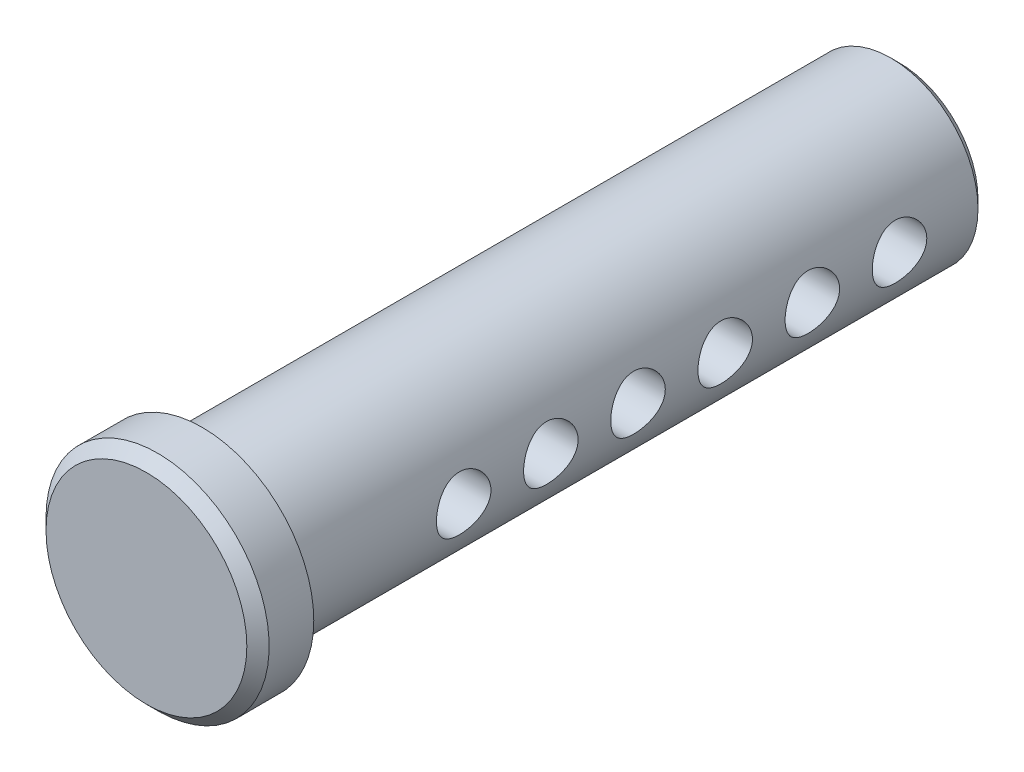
from build123d import *

# Parameters (mm, degrees)
SKETCH1_R       = 6.35
EXTRUDE1_DEPTH  = 25.4
SKETCH2_R       = 8.128
EXTRUDE2_DEPTH  = 4.064
CHAMFER1_SIZE   = 0.8128
SKETCH3_R       = 1.984375
EXTRUDE3_DEPTH  = 32.62682507
LPATTERN1_COUNT = 6
LPATTERN1_PITCH = 6.35
CHAMFER2_SIZE   = 0.635


with BuildPart() as part:
    # Sketch1 → Extrude1 (new, symmetric)
    with BuildSketch(Plane.XY):
        Circle(SKETCH1_R)
    extrude(amount=EXTRUDE1_DEPTH, both=True)

    # Sketch2 → Extrude2 (add)
    with BuildSketch(Plane.XY.offset(25.4)):
        Circle(SKETCH2_R)
    extrude(amount=EXTRUDE2_DEPTH)

    # Chamfer1
    chamfer1_edges = [part.edges().sort_by_distance(p)[0] for p in [
        (-8.128, 0, 29.464),
    ]]
    chamfer(chamfer1_edges, length=CHAMFER1_SIZE)

    # Sketch3 → Extrude3 (cut, symmetric)
    with BuildSketch(Plane(origin=(0, 0, 0), x_dir=(0, 0, -1), z_dir=(1, 0, 0))):
        with Locations(Location((19.05, 0, 0), (0, 0, 179.999999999))):
            Circle(SKETCH3_R)
    extrude3 = extrude(amount=EXTRUDE3_DEPTH, both=True, mode=Mode.SUBTRACT)

    # LPattern1: Extrude3 ×6
    with Locations(*[(0, 0, i * LPATTERN1_PITCH) for i in range(1, LPATTERN1_COUNT)]):
        add(extrude3, mode=Mode.SUBTRACT)

    # Chamfer2
    chamfer2_edges = [part.edges().sort_by_distance(p)[0] for p in [
        (-6.35, 0, -25.4),
    ]]
    chamfer(chamfer2_edges, length=CHAMFER2_SIZE)


solid = part.part
